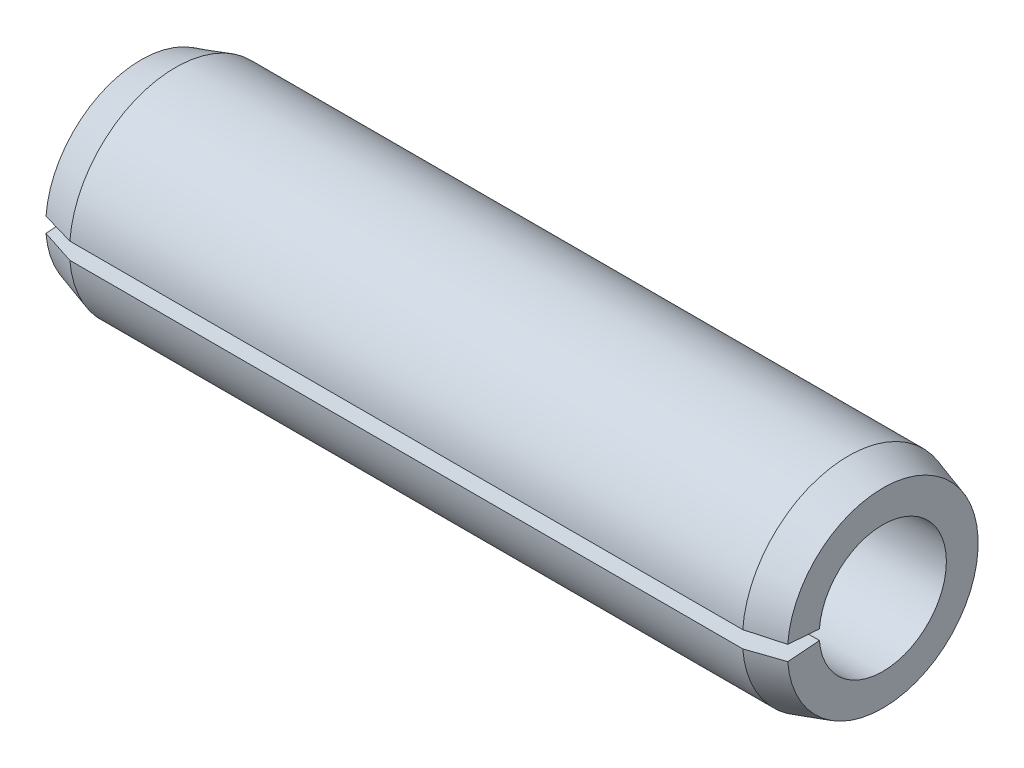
from build123d import *

# Parameters (mm, degrees)
GAP_DEPTH = 15.282856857


with BuildPart() as part:
    # Sketch1 → Base-Revolve (revolve)
    with BuildSketch(Plane.XY, mode=Mode.PRIVATE) as base_revolve_sk:
        Polygon((0, 1.2), (14, 1.2), (14, 1.8), (13.35, 2), (0.65, 2), (0, 1.8), align=None)
    revolve(base_revolve_sk.sketch.rotate(Axis((-9.525, 0, 0), (1, 0, 0)), 90), axis=Axis((-9.525, 0, 0), (1, 0, 0)))

    # Sketch2 → Gap (cut, through all)
    with BuildSketch(Plane(origin=(0, 0, 0), x_dir=(0, -1, 0), z_dir=(-1, 0, 0))):
        with BuildLine():
            Line((0, 0), (0.160056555, 2.033711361))
            ThreePointArc((0.160056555, 2.033711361), (0, 2.04), (-0.160056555, 2.033711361))
            Line((-0.160056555, 2.033711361), (0, 0))
        make_face()
    extrude(amount=-GAP_DEPTH, mode=Mode.SUBTRACT)


solid = part.part
